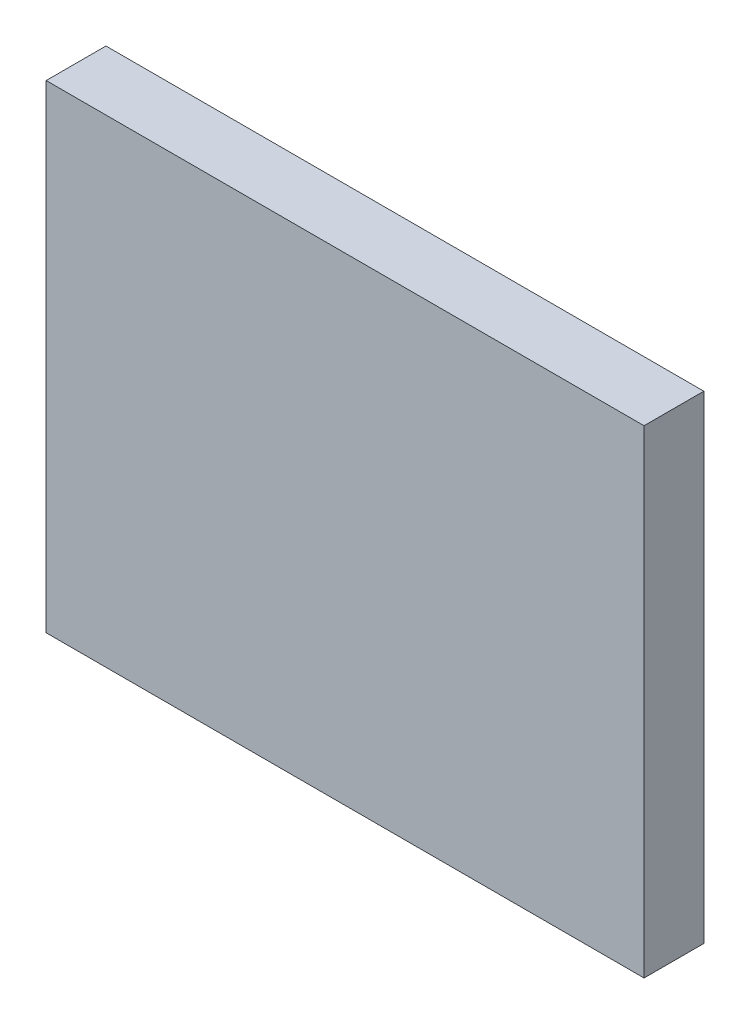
ISO-10303-21;
HEADER;
FILE_DESCRIPTION(('STEP AP214'),'2;1');
FILE_NAME('part.step','',(''),(''),'','','');
FILE_SCHEMA(('AUTOMOTIVE_DESIGN { 1 0 10303 214 1 1 1 1 }'));
ENDSEC;
DATA;
#1=APPLICATION_CONTEXT('core data for automotive mechanical design processes');
#2=APPLICATION_PROTOCOL_DEFINITION('international standard','automotive_design',2000,#1);
#3=PRODUCT_CONTEXT('',#1,'mechanical');
#4=PRODUCT('Part','Part','',(#3));
#5=PRODUCT_RELATED_PRODUCT_CATEGORY('part','',(#4));
#6=PRODUCT_DEFINITION_FORMATION('','',#4);
#7=PRODUCT_DEFINITION_CONTEXT('part definition',#1,'design');
#8=PRODUCT_DEFINITION('design','',#6,#7);
#9=PRODUCT_DEFINITION_SHAPE('','',#8);
#10=(LENGTH_UNIT() NAMED_UNIT(*) SI_UNIT(.MILLI.,.METRE.));
#11=(NAMED_UNIT(*) PLANE_ANGLE_UNIT() SI_UNIT($,.RADIAN.));
#12=(NAMED_UNIT(*) SI_UNIT($,.STERADIAN.) SOLID_ANGLE_UNIT());
#13=UNCERTAINTY_MEASURE_WITH_UNIT(LENGTH_MEASURE(1.E-05),#10,'distance_accuracy_value','');
#14=(GEOMETRIC_REPRESENTATION_CONTEXT(3) GLOBAL_UNCERTAINTY_ASSIGNED_CONTEXT((#13)) GLOBAL_UNIT_ASSIGNED_CONTEXT((#10,
#11,#12)) REPRESENTATION_CONTEXT('',''));
#15=CARTESIAN_POINT('',(0.,0.,0.));
#16=DIRECTION('',(0.,0.,1.));
#17=DIRECTION('',(1.,0.,0.));
#18=AXIS2_PLACEMENT_3D('',#15,#16,#17);
#19=CARTESIAN_POINT('',(0.,0.,20.));
#20=DIRECTION('',(0.,0.,1.));
#21=DIRECTION('',(1.,0.,0.));
#22=AXIS2_PLACEMENT_3D('',#19,#20,#21);
#23=PLANE('',#22);
#24=DIRECTION('',(1.,0.,0.));
#25=VECTOR('',#24,1.);
#26=CARTESIAN_POINT('',(-100.,-80.,20.));
#27=LINE('',#26,#25);
#28=CARTESIAN_POINT('',(-100.,-80.,20.));
#29=VERTEX_POINT('',#28);
#30=CARTESIAN_POINT('',(100.,-80.,20.));
#31=VERTEX_POINT('',#30);
#32=EDGE_CURVE('E78',#29,#31,#27,.T.);
#33=ORIENTED_EDGE('',*,*,#32,.T.);
#34=DIRECTION('',(0.,1.,0.));
#35=VECTOR('',#34,1.);
#36=CARTESIAN_POINT('',(100.,-80.,20.));
#37=LINE('',#36,#35);
#38=CARTESIAN_POINT('',(100.,80.,20.));
#39=VERTEX_POINT('',#38);
#40=EDGE_CURVE('E101',#31,#39,#37,.T.);
#41=ORIENTED_EDGE('',*,*,#40,.T.);
#42=DIRECTION('',(-1.,0.,0.));
#43=VECTOR('',#42,1.);
#44=CARTESIAN_POINT('',(100.,80.,20.));
#45=LINE('',#44,#43);
#46=CARTESIAN_POINT('',(-100.,80.,20.));
#47=VERTEX_POINT('',#46);
#48=EDGE_CURVE('E71',#39,#47,#45,.T.);
#49=ORIENTED_EDGE('',*,*,#48,.T.);
#50=DIRECTION('',(0.,-1.,0.));
#51=VECTOR('',#50,1.);
#52=CARTESIAN_POINT('',(-100.,80.,20.));
#53=LINE('',#52,#51);
#54=EDGE_CURVE('E10',#47,#29,#53,.T.);
#55=ORIENTED_EDGE('',*,*,#54,.T.);
#56=EDGE_LOOP('',(#33,#41,#49,#55));
#57=FACE_BOUND('',#56,.T.);
#58=ADVANCED_FACE('F16',(#57),#23,.T.);
#59=CARTESIAN_POINT('',(0.,0.,0.));
#60=DIRECTION('',(0.,0.,1.));
#61=DIRECTION('',(1.,0.,0.));
#62=AXIS2_PLACEMENT_3D('',#59,#60,#61);
#63=PLANE('',#62);
#64=DIRECTION('',(0.,-1.,0.));
#65=VECTOR('',#64,1.);
#66=CARTESIAN_POINT('',(-100.,80.,0.));
#67=LINE('',#66,#65);
#68=CARTESIAN_POINT('',(-100.,80.,0.));
#69=VERTEX_POINT('',#68);
#70=CARTESIAN_POINT('',(-100.,-80.,0.));
#71=VERTEX_POINT('',#70);
#72=EDGE_CURVE('E26',#69,#71,#67,.T.);
#73=ORIENTED_EDGE('',*,*,#72,.F.);
#74=DIRECTION('',(-1.,0.,0.));
#75=VECTOR('',#74,1.);
#76=CARTESIAN_POINT('',(100.,80.,0.));
#77=LINE('',#76,#75);
#78=CARTESIAN_POINT('',(100.,80.,0.));
#79=VERTEX_POINT('',#78);
#80=EDGE_CURVE('E106',#79,#69,#77,.T.);
#81=ORIENTED_EDGE('',*,*,#80,.F.);
#82=DIRECTION('',(0.,1.,0.));
#83=VECTOR('',#82,1.);
#84=CARTESIAN_POINT('',(100.,-80.,0.));
#85=LINE('',#84,#83);
#86=CARTESIAN_POINT('',(100.,-80.,0.));
#87=VERTEX_POINT('',#86);
#88=EDGE_CURVE('E80',#87,#79,#85,.T.);
#89=ORIENTED_EDGE('',*,*,#88,.F.);
#90=DIRECTION('',(1.,0.,0.));
#91=VECTOR('',#90,1.);
#92=CARTESIAN_POINT('',(-100.,-80.,0.));
#93=LINE('',#92,#91);
#94=EDGE_CURVE('E76',#71,#87,#93,.T.);
#95=ORIENTED_EDGE('',*,*,#94,.F.);
#96=EDGE_LOOP('',(#73,#81,#89,#95));
#97=FACE_BOUND('',#96,.T.);
#98=ADVANCED_FACE('F82',(#97),#63,.F.);
#99=CARTESIAN_POINT('',(-100.,80.,0.));
#100=DIRECTION('',(1.,0.,0.));
#101=DIRECTION('',(0.,1.,0.));
#102=AXIS2_PLACEMENT_3D('',#99,#100,#101);
#103=PLANE('',#102);
#104=ORIENTED_EDGE('',*,*,#72,.T.);
#105=DIRECTION('',(0.,0.,1.));
#106=VECTOR('',#105,1.);
#107=CARTESIAN_POINT('',(-100.,-80.,0.));
#108=LINE('',#107,#106);
#109=EDGE_CURVE('E64',#71,#29,#108,.T.);
#110=ORIENTED_EDGE('',*,*,#109,.T.);
#111=ORIENTED_EDGE('',*,*,#54,.F.);
#112=DIRECTION('',(0.,0.,1.));
#113=VECTOR('',#112,1.);
#114=CARTESIAN_POINT('',(-100.,80.,0.));
#115=LINE('',#114,#113);
#116=EDGE_CURVE('E19',#69,#47,#115,.T.);
#117=ORIENTED_EDGE('',*,*,#116,.F.);
#118=EDGE_LOOP('',(#104,#110,#111,#117));
#119=FACE_BOUND('',#118,.T.);
#120=ADVANCED_FACE('F63',(#119),#103,.F.);
#121=CARTESIAN_POINT('',(100.,80.,0.));
#122=DIRECTION('',(0.,-1.,0.));
#123=DIRECTION('',(0.,0.,-1.));
#124=AXIS2_PLACEMENT_3D('',#121,#122,#123);
#125=PLANE('',#124);
#126=ORIENTED_EDGE('',*,*,#80,.T.);
#127=ORIENTED_EDGE('',*,*,#116,.T.);
#128=ORIENTED_EDGE('',*,*,#48,.F.);
#129=DIRECTION('',(0.,0.,1.));
#130=VECTOR('',#129,1.);
#131=CARTESIAN_POINT('',(100.,80.,0.));
#132=LINE('',#131,#130);
#133=EDGE_CURVE('E98',#79,#39,#132,.T.);
#134=ORIENTED_EDGE('',*,*,#133,.F.);
#135=EDGE_LOOP('',(#126,#127,#128,#134));
#136=FACE_BOUND('',#135,.T.);
#137=ADVANCED_FACE('F115',(#136),#125,.F.);
#138=CARTESIAN_POINT('',(100.,-80.,0.));
#139=DIRECTION('',(-1.,0.,0.));
#140=DIRECTION('',(0.,0.,1.));
#141=AXIS2_PLACEMENT_3D('',#138,#139,#140);
#142=PLANE('',#141);
#143=ORIENTED_EDGE('',*,*,#88,.T.);
#144=ORIENTED_EDGE('',*,*,#133,.T.);
#145=ORIENTED_EDGE('',*,*,#40,.F.);
#146=DIRECTION('',(0.,0.,1.));
#147=VECTOR('',#146,1.);
#148=CARTESIAN_POINT('',(100.,-80.,0.));
#149=LINE('',#148,#147);
#150=EDGE_CURVE('E86',#87,#31,#149,.T.);
#151=ORIENTED_EDGE('',*,*,#150,.F.);
#152=EDGE_LOOP('',(#143,#144,#145,#151));
#153=FACE_BOUND('',#152,.T.);
#154=ADVANCED_FACE('F118',(#153),#142,.F.);
#155=CARTESIAN_POINT('',(-100.,-80.,0.));
#156=DIRECTION('',(0.,1.,0.));
#157=DIRECTION('',(1.,0.,0.));
#158=AXIS2_PLACEMENT_3D('',#155,#156,#157);
#159=PLANE('',#158);
#160=ORIENTED_EDGE('',*,*,#94,.T.);
#161=ORIENTED_EDGE('',*,*,#150,.T.);
#162=ORIENTED_EDGE('',*,*,#32,.F.);
#163=ORIENTED_EDGE('',*,*,#109,.F.);
#164=EDGE_LOOP('',(#160,#161,#162,#163));
#165=FACE_BOUND('',#164,.T.);
#166=ADVANCED_FACE('F74',(#165),#159,.F.);
#167=CLOSED_SHELL('',(#58,#98,#120,#137,#154,#166));
#168=MANIFOLD_SOLID_BREP('B1',#167);
#169=ADVANCED_BREP_SHAPE_REPRESENTATION('',(#18,#168),#14);
#170=SHAPE_DEFINITION_REPRESENTATION(#9,#169);
ENDSEC;
END-ISO-10303-21;
